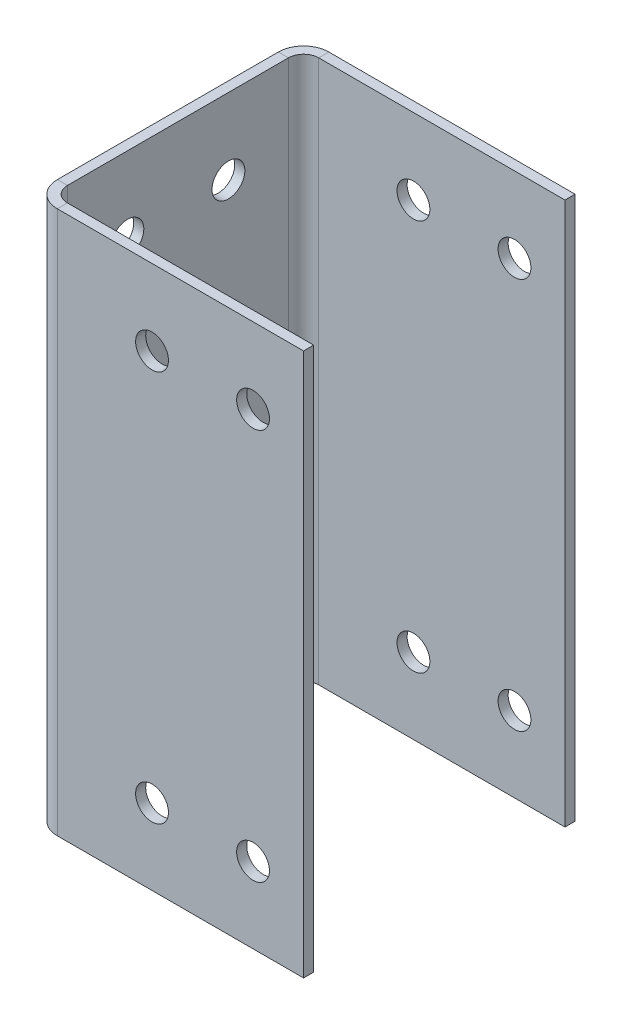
ISO-10303-21;
HEADER;
FILE_DESCRIPTION(('STEP AP214'),'2;1');
FILE_NAME('part.step','',(''),(''),'','','');
FILE_SCHEMA(('AUTOMOTIVE_DESIGN { 1 0 10303 214 1 1 1 1 }'));
ENDSEC;
DATA;
#1=APPLICATION_CONTEXT('core data for automotive mechanical design processes');
#2=APPLICATION_PROTOCOL_DEFINITION('international standard','automotive_design',2000,#1);
#3=PRODUCT_CONTEXT('',#1,'mechanical');
#4=PRODUCT('Part','Part','',(#3));
#5=PRODUCT_RELATED_PRODUCT_CATEGORY('part','',(#4));
#6=PRODUCT_DEFINITION_FORMATION('','',#4);
#7=PRODUCT_DEFINITION_CONTEXT('part definition',#1,'design');
#8=PRODUCT_DEFINITION('design','',#6,#7);
#9=PRODUCT_DEFINITION_SHAPE('','',#8);
#10=(LENGTH_UNIT() NAMED_UNIT(*) SI_UNIT(.MILLI.,.METRE.));
#11=(NAMED_UNIT(*) PLANE_ANGLE_UNIT() SI_UNIT($,.RADIAN.));
#12=(NAMED_UNIT(*) SI_UNIT($,.STERADIAN.) SOLID_ANGLE_UNIT());
#13=UNCERTAINTY_MEASURE_WITH_UNIT(LENGTH_MEASURE(1.E-05),#10,'distance_accuracy_value','');
#14=(GEOMETRIC_REPRESENTATION_CONTEXT(3) GLOBAL_UNCERTAINTY_ASSIGNED_CONTEXT((#13)) GLOBAL_UNIT_ASSIGNED_CONTEXT((#10,
#11,#12)) REPRESENTATION_CONTEXT('',''));
#15=CARTESIAN_POINT('',(0.,0.,0.));
#16=DIRECTION('',(0.,0.,1.));
#17=DIRECTION('',(1.,0.,0.));
#18=AXIS2_PLACEMENT_3D('',#15,#16,#17);
#19=CARTESIAN_POINT('',(-8.,0.,0.));
#20=DIRECTION('',(1.,0.,0.));
#21=DIRECTION('',(0.,0.,-1.));
#22=AXIS2_PLACEMENT_3D('',#19,#20,#21);
#23=PLANE('',#22);
#24=CARTESIAN_POINT('',(-8.,60.,67.5000000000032));
#25=DIRECTION('',(-1.,0.,0.));
#26=DIRECTION('',(0.,0.,1.));
#27=AXIS2_PLACEMENT_3D('',#24,#25,#26);
#28=CIRCLE('',#27,13.);
#29=CARTESIAN_POINT('',(-8.,60.,80.5000000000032));
#30=VERTEX_POINT('',#29);
#31=EDGE_CURVE('E770',#30,#30,#28,.T.);
#32=ORIENTED_EDGE('',*,*,#31,.F.);
#33=EDGE_LOOP('',(#32));
#34=FACE_BOUND('',#33,.T.);
#35=CARTESIAN_POINT('',(-8.,60.,147.500000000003));
#36=DIRECTION('',(-1.,0.,0.));
#37=DIRECTION('',(0.,0.,1.));
#38=AXIS2_PLACEMENT_3D('',#35,#36,#37);
#39=CIRCLE('',#38,13.);
#40=CARTESIAN_POINT('',(-8.,60.,160.500000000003));
#41=VERTEX_POINT('',#40);
#42=EDGE_CURVE('E771',#41,#41,#39,.T.);
#43=ORIENTED_EDGE('',*,*,#42,.F.);
#44=EDGE_LOOP('',(#43));
#45=FACE_BOUND('',#44,.T.);
#46=CARTESIAN_POINT('',(-8.,370.,147.5));
#47=DIRECTION('',(-1.,0.,0.));
#48=DIRECTION('',(0.,0.,1.));
#49=AXIS2_PLACEMENT_3D('',#46,#47,#48);
#50=CIRCLE('',#49,13.);
#51=CARTESIAN_POINT('',(-8.,370.,160.5));
#52=VERTEX_POINT('',#51);
#53=EDGE_CURVE('E774',#52,#52,#50,.T.);
#54=ORIENTED_EDGE('',*,*,#53,.F.);
#55=EDGE_LOOP('',(#54));
#56=FACE_BOUND('',#55,.T.);
#57=CARTESIAN_POINT('',(-8.,370.,67.5));
#58=DIRECTION('',(-1.,0.,0.));
#59=DIRECTION('',(0.,0.,1.));
#60=AXIS2_PLACEMENT_3D('',#57,#58,#59);
#61=CIRCLE('',#60,13.);
#62=CARTESIAN_POINT('',(-8.,370.,80.5));
#63=VERTEX_POINT('',#62);
#64=EDGE_CURVE('E311',#63,#63,#61,.T.);
#65=ORIENTED_EDGE('',*,*,#64,.F.);
#66=EDGE_LOOP('',(#65));
#67=FACE_BOUND('',#66,.T.);
#68=DIRECTION('',(0.,1.,0.));
#69=VECTOR('',#68,1.);
#70=CARTESIAN_POINT('',(-8.00000000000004,430.,20.));
#71=LINE('',#70,#69);
#72=CARTESIAN_POINT('',(-8.00000000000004,430.,20.));
#73=VERTEX_POINT('',#72);
#74=CARTESIAN_POINT('',(-8.,0.,20.));
#75=VERTEX_POINT('',#74);
#76=EDGE_CURVE('E213',#73,#75,#71,.F.);
#77=ORIENTED_EDGE('',*,*,#76,.T.);
#78=DIRECTION('',(0.,0.,-1.));
#79=VECTOR('',#78,1.);
#80=CARTESIAN_POINT('',(-8.,0.,0.));
#81=LINE('',#80,#79);
#82=CARTESIAN_POINT('',(-8.00000000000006,0.,195.));
#83=VERTEX_POINT('',#82);
#84=EDGE_CURVE('E13',#83,#75,#81,.T.);
#85=ORIENTED_EDGE('',*,*,#84,.F.);
#86=DIRECTION('',(0.,-1.,0.));
#87=VECTOR('',#86,1.);
#88=CARTESIAN_POINT('',(-8.00000000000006,0.,195.));
#89=LINE('',#88,#87);
#90=CARTESIAN_POINT('',(-8.,430.,195.));
#91=VERTEX_POINT('',#90);
#92=EDGE_CURVE('E266',#83,#91,#89,.F.);
#93=ORIENTED_EDGE('',*,*,#92,.T.);
#94=DIRECTION('',(0.,0.,1.));
#95=VECTOR('',#94,1.);
#96=CARTESIAN_POINT('',(-8.,430.,0.));
#97=LINE('',#96,#95);
#98=EDGE_CURVE('E88',#73,#91,#97,.T.);
#99=ORIENTED_EDGE('',*,*,#98,.F.);
#100=EDGE_LOOP('',(#77,#85,#93,#99));
#101=FACE_BOUND('',#100,.T.);
#102=ADVANCED_FACE('F79',(#34,#45,#56,#67,#101),#23,.F.);
#103=CARTESIAN_POINT('',(0.,0.,0.));
#104=DIRECTION('',(1.,0.,0.));
#105=DIRECTION('',(0.,0.,-1.));
#106=AXIS2_PLACEMENT_3D('',#103,#104,#105);
#107=PLANE('',#106);
#108=CARTESIAN_POINT('',(0.,60.,67.5000000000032));
#109=DIRECTION('',(1.,0.,0.));
#110=DIRECTION('',(0.,0.,-1.));
#111=AXIS2_PLACEMENT_3D('',#108,#109,#110);
#112=CIRCLE('',#111,13.);
#113=CARTESIAN_POINT('',(0.,60.,54.5000000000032));
#114=VERTEX_POINT('',#113);
#115=EDGE_CURVE('E83',#114,#114,#112,.T.);
#116=ORIENTED_EDGE('',*,*,#115,.F.);
#117=EDGE_LOOP('',(#116));
#118=FACE_BOUND('',#117,.T.);
#119=CARTESIAN_POINT('',(0.,60.,147.500000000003));
#120=DIRECTION('',(1.,0.,0.));
#121=DIRECTION('',(0.,0.,-1.));
#122=AXIS2_PLACEMENT_3D('',#119,#120,#121);
#123=CIRCLE('',#122,13.);
#124=CARTESIAN_POINT('',(0.,60.,134.500000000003));
#125=VERTEX_POINT('',#124);
#126=EDGE_CURVE('E313',#125,#125,#123,.T.);
#127=ORIENTED_EDGE('',*,*,#126,.F.);
#128=EDGE_LOOP('',(#127));
#129=FACE_BOUND('',#128,.T.);
#130=CARTESIAN_POINT('',(0.,370.,147.5));
#131=DIRECTION('',(1.,0.,0.));
#132=DIRECTION('',(0.,0.,-1.));
#133=AXIS2_PLACEMENT_3D('',#130,#131,#132);
#134=CIRCLE('',#133,13.);
#135=CARTESIAN_POINT('',(0.,370.,134.5));
#136=VERTEX_POINT('',#135);
#137=EDGE_CURVE('E310',#136,#136,#134,.T.);
#138=ORIENTED_EDGE('',*,*,#137,.F.);
#139=EDGE_LOOP('',(#138));
#140=FACE_BOUND('',#139,.T.);
#141=CARTESIAN_POINT('',(0.,370.,67.5));
#142=DIRECTION('',(1.,0.,0.));
#143=DIRECTION('',(0.,0.,-1.));
#144=AXIS2_PLACEMENT_3D('',#141,#142,#143);
#145=CIRCLE('',#144,13.);
#146=CARTESIAN_POINT('',(0.,370.,54.5));
#147=VERTEX_POINT('',#146);
#148=EDGE_CURVE('E307',#147,#147,#145,.T.);
#149=ORIENTED_EDGE('',*,*,#148,.F.);
#150=EDGE_LOOP('',(#149));
#151=FACE_BOUND('',#150,.T.);
#152=DIRECTION('',(0.,0.,-1.));
#153=VECTOR('',#152,1.);
#154=CARTESIAN_POINT('',(0.,0.,0.));
#155=LINE('',#154,#153);
#156=CARTESIAN_POINT('',(0.,0.,195.));
#157=VERTEX_POINT('',#156);
#158=CARTESIAN_POINT('',(0.,0.,20.));
#159=VERTEX_POINT('',#158);
#160=EDGE_CURVE('E287',#157,#159,#155,.T.);
#161=ORIENTED_EDGE('',*,*,#160,.T.);
#162=DIRECTION('',(0.,1.,0.));
#163=VECTOR('',#162,1.);
#164=CARTESIAN_POINT('',(0.,430.,20.));
#165=LINE('',#164,#163);
#166=CARTESIAN_POINT('',(0.,430.,20.));
#167=VERTEX_POINT('',#166);
#168=EDGE_CURVE('E225',#167,#159,#165,.F.);
#169=ORIENTED_EDGE('',*,*,#168,.F.);
#170=DIRECTION('',(0.,0.,1.));
#171=VECTOR('',#170,1.);
#172=CARTESIAN_POINT('',(0.,430.,0.));
#173=LINE('',#172,#171);
#174=CARTESIAN_POINT('',(0.,430.,195.));
#175=VERTEX_POINT('',#174);
#176=EDGE_CURVE('E284',#167,#175,#173,.T.);
#177=ORIENTED_EDGE('',*,*,#176,.T.);
#178=DIRECTION('',(0.,-1.,0.));
#179=VECTOR('',#178,1.);
#180=CARTESIAN_POINT('',(0.,0.,195.));
#181=LINE('',#180,#179);
#182=EDGE_CURVE('E96',#157,#175,#181,.F.);
#183=ORIENTED_EDGE('',*,*,#182,.F.);
#184=EDGE_LOOP('',(#161,#169,#177,#183));
#185=FACE_BOUND('',#184,.T.);
#186=ADVANCED_FACE('F370',(#118,#129,#140,#151,#185),#107,.T.);
#187=CARTESIAN_POINT('',(-8.,430.,0.));
#188=DIRECTION('',(0.,1.,0.));
#189=DIRECTION('',(0.,0.,1.));
#190=AXIS2_PLACEMENT_3D('',#187,#188,#189);
#191=PLANE('',#190);
#192=ORIENTED_EDGE('',*,*,#176,.F.);
#193=DIRECTION('',(-1.,0.,0.));
#194=VECTOR('',#193,1.);
#195=CARTESIAN_POINT('',(0.,430.,20.));
#196=LINE('',#195,#194);
#197=EDGE_CURVE('E219',#167,#73,#196,.T.);
#198=ORIENTED_EDGE('',*,*,#197,.T.);
#199=ORIENTED_EDGE('',*,*,#98,.T.);
#200=DIRECTION('',(-1.,0.,0.));
#201=VECTOR('',#200,1.);
#202=CARTESIAN_POINT('',(0.,430.,195.));
#203=LINE('',#202,#201);
#204=EDGE_CURVE('E281',#175,#91,#203,.T.);
#205=ORIENTED_EDGE('',*,*,#204,.F.);
#206=EDGE_LOOP('',(#192,#198,#199,#205));
#207=FACE_BOUND('',#206,.T.);
#208=ADVANCED_FACE('F81',(#207),#191,.T.);
#209=CARTESIAN_POINT('',(-8.,0.,0.));
#210=DIRECTION('',(0.,-1.,0.));
#211=DIRECTION('',(0.,0.,-1.));
#212=AXIS2_PLACEMENT_3D('',#209,#210,#211);
#213=PLANE('',#212);
#214=DIRECTION('',(-1.,0.,0.));
#215=VECTOR('',#214,1.);
#216=CARTESIAN_POINT('',(0.,0.,20.));
#217=LINE('',#216,#215);
#218=EDGE_CURVE('E231',#159,#75,#217,.T.);
#219=ORIENTED_EDGE('',*,*,#218,.F.);
#220=ORIENTED_EDGE('',*,*,#160,.F.);
#221=DIRECTION('',(-1.,0.,0.));
#222=VECTOR('',#221,1.);
#223=CARTESIAN_POINT('',(0.,0.,195.));
#224=LINE('',#223,#222);
#225=EDGE_CURVE('E272',#157,#83,#224,.T.);
#226=ORIENTED_EDGE('',*,*,#225,.T.);
#227=ORIENTED_EDGE('',*,*,#84,.T.);
#228=EDGE_LOOP('',(#219,#220,#226,#227));
#229=FACE_BOUND('',#228,.T.);
#230=ADVANCED_FACE('F383',(#229),#213,.T.);
#231=CARTESIAN_POINT('',(12.,430.,195.));
#232=DIRECTION('',(0.,1.,0.));
#233=DIRECTION('',(0.,0.,1.));
#234=AXIS2_PLACEMENT_3D('',#231,#232,#233);
#235=PLANE('',#234);
#236=DIRECTION('',(0.,0.,-1.));
#237=VECTOR('',#236,1.);
#238=CARTESIAN_POINT('',(12.,430.,215.));
#239=LINE('',#238,#237);
#240=CARTESIAN_POINT('',(11.9999999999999,430.,207.));
#241=VERTEX_POINT('',#240);
#242=CARTESIAN_POINT('',(11.9999999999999,430.,215.));
#243=VERTEX_POINT('',#242);
#244=EDGE_CURVE('E234',#241,#243,#239,.F.);
#245=ORIENTED_EDGE('',*,*,#244,.F.);
#246=CARTESIAN_POINT('',(12.,430.,195.));
#247=DIRECTION('',(0.,-1.,0.));
#248=DIRECTION('',(0.,0.,-1.));
#249=AXIS2_PLACEMENT_3D('',#246,#247,#248);
#250=CIRCLE('',#249,12.);
#251=EDGE_CURVE('E275',#175,#241,#250,.F.);
#252=ORIENTED_EDGE('',*,*,#251,.F.);
#253=ORIENTED_EDGE('',*,*,#204,.T.);
#254=CARTESIAN_POINT('',(12.,430.,195.));
#255=DIRECTION('',(0.,-1.,0.));
#256=DIRECTION('',(0.,0.,-1.));
#257=AXIS2_PLACEMENT_3D('',#254,#255,#256);
#258=CIRCLE('',#257,20.);
#259=EDGE_CURVE('E268',#91,#243,#258,.F.);
#260=ORIENTED_EDGE('',*,*,#259,.T.);
#261=EDGE_LOOP('',(#245,#252,#253,#260));
#262=FACE_BOUND('',#261,.T.);
#263=ADVANCED_FACE('F385',(#262),#235,.T.);
#264=CARTESIAN_POINT('',(12.,0.,195.));
#265=DIRECTION('',(0.,1.,0.));
#266=DIRECTION('',(0.,0.,1.));
#267=AXIS2_PLACEMENT_3D('',#264,#265,#266);
#268=PLANE('',#267);
#269=CARTESIAN_POINT('',(12.,0.,195.));
#270=DIRECTION('',(0.,-1.,0.));
#271=DIRECTION('',(0.,0.,-1.));
#272=AXIS2_PLACEMENT_3D('',#269,#270,#271);
#273=CIRCLE('',#272,12.);
#274=CARTESIAN_POINT('',(11.9999999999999,0.,207.));
#275=VERTEX_POINT('',#274);
#276=EDGE_CURVE('E239',#275,#157,#273,.T.);
#277=ORIENTED_EDGE('',*,*,#276,.F.);
#278=DIRECTION('',(0.,0.,-1.));
#279=VECTOR('',#278,1.);
#280=CARTESIAN_POINT('',(12.,0.,207.));
#281=LINE('',#280,#279);
#282=CARTESIAN_POINT('',(12.,0.,215.));
#283=VERTEX_POINT('',#282);
#284=EDGE_CURVE('E259',#275,#283,#281,.F.);
#285=ORIENTED_EDGE('',*,*,#284,.T.);
#286=CARTESIAN_POINT('',(12.,0.,195.));
#287=DIRECTION('',(0.,-1.,0.));
#288=DIRECTION('',(0.,0.,-1.));
#289=AXIS2_PLACEMENT_3D('',#286,#287,#288);
#290=CIRCLE('',#289,20.);
#291=EDGE_CURVE('E269',#283,#83,#290,.T.);
#292=ORIENTED_EDGE('',*,*,#291,.T.);
#293=ORIENTED_EDGE('',*,*,#225,.F.);
#294=EDGE_LOOP('',(#277,#285,#292,#293));
#295=FACE_BOUND('',#294,.T.);
#296=ADVANCED_FACE('F381',(#295),#268,.F.);
#297=CARTESIAN_POINT('',(12.,0.,195.));
#298=DIRECTION('',(0.,-1.,0.));
#299=DIRECTION('',(0.,0.,1.));
#300=AXIS2_PLACEMENT_3D('',#297,#298,#299);
#301=CYLINDRICAL_SURFACE('',#300,20.);
#302=ORIENTED_EDGE('',*,*,#92,.F.);
#303=ORIENTED_EDGE('',*,*,#291,.F.);
#304=DIRECTION('',(0.,-1.,0.));
#305=VECTOR('',#304,1.);
#306=CARTESIAN_POINT('',(12.,430.,215.));
#307=LINE('',#306,#305);
#308=EDGE_CURVE('E257',#283,#243,#307,.F.);
#309=ORIENTED_EDGE('',*,*,#308,.T.);
#310=ORIENTED_EDGE('',*,*,#259,.F.);
#311=EDGE_LOOP('',(#302,#303,#309,#310));
#312=FACE_BOUND('',#311,.T.);
#313=ADVANCED_FACE('F441',(#312),#301,.T.);
#314=CARTESIAN_POINT('',(12.,0.,195.));
#315=DIRECTION('',(0.,-1.,0.));
#316=DIRECTION('',(0.,0.,1.));
#317=AXIS2_PLACEMENT_3D('',#314,#315,#316);
#318=CYLINDRICAL_SURFACE('',#317,12.);
#319=ORIENTED_EDGE('',*,*,#182,.T.);
#320=ORIENTED_EDGE('',*,*,#251,.T.);
#321=DIRECTION('',(0.,-1.,0.));
#322=VECTOR('',#321,1.);
#323=CARTESIAN_POINT('',(12.,430.,207.));
#324=LINE('',#323,#322);
#325=EDGE_CURVE('E262',#241,#275,#324,.T.);
#326=ORIENTED_EDGE('',*,*,#325,.T.);
#327=ORIENTED_EDGE('',*,*,#276,.T.);
#328=EDGE_LOOP('',(#319,#320,#326,#327));
#329=FACE_BOUND('',#328,.T.);
#330=ADVANCED_FACE('F405',(#329),#318,.F.);
#331=CARTESIAN_POINT('',(0.,430.,215.));
#332=DIRECTION('',(0.,-1.,0.));
#333=DIRECTION('',(0.,0.,-1.));
#334=AXIS2_PLACEMENT_3D('',#331,#332,#333);
#335=PLANE('',#334);
#336=ORIENTED_EDGE('',*,*,#244,.T.);
#337=DIRECTION('',(-1.,0.,0.));
#338=VECTOR('',#337,1.);
#339=CARTESIAN_POINT('',(-7.77466477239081E-13,430.,215.));
#340=LINE('',#339,#338);
#341=CARTESIAN_POINT('',(207.,430.,215.000000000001));
#342=VERTEX_POINT('',#341);
#343=EDGE_CURVE('E247',#342,#243,#340,.T.);
#344=ORIENTED_EDGE('',*,*,#343,.F.);
#345=DIRECTION('',(0.,0.,-1.));
#346=VECTOR('',#345,1.);
#347=CARTESIAN_POINT('',(207.,430.,215.000000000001));
#348=LINE('',#347,#346);
#349=CARTESIAN_POINT('',(207.,430.,207.000000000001));
#350=VERTEX_POINT('',#349);
#351=EDGE_CURVE('E240',#342,#350,#348,.T.);
#352=ORIENTED_EDGE('',*,*,#351,.T.);
#353=DIRECTION('',(1.,0.,0.));
#354=VECTOR('',#353,1.);
#355=CARTESIAN_POINT('',(0.,430.,207.));
#356=LINE('',#355,#354);
#357=EDGE_CURVE('E254',#350,#241,#356,.F.);
#358=ORIENTED_EDGE('',*,*,#357,.T.);
#359=EDGE_LOOP('',(#336,#344,#352,#358));
#360=FACE_BOUND('',#359,.T.);
#361=ADVANCED_FACE('F410',(#360),#335,.F.);
#362=CARTESIAN_POINT('',(207.,0.,215.000000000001));
#363=DIRECTION('',(0.,1.,0.));
#364=DIRECTION('',(0.,0.,1.));
#365=AXIS2_PLACEMENT_3D('',#362,#363,#364);
#366=PLANE('',#365);
#367=ORIENTED_EDGE('',*,*,#284,.F.);
#368=DIRECTION('',(-1.,0.,0.));
#369=VECTOR('',#368,1.);
#370=CARTESIAN_POINT('',(207.,0.,207.000000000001));
#371=LINE('',#370,#369);
#372=CARTESIAN_POINT('',(207.,0.,207.000000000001));
#373=VERTEX_POINT('',#372);
#374=EDGE_CURVE('E252',#275,#373,#371,.F.);
#375=ORIENTED_EDGE('',*,*,#374,.T.);
#376=DIRECTION('',(0.,0.,-1.));
#377=VECTOR('',#376,1.);
#378=CARTESIAN_POINT('',(207.,0.,215.000000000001));
#379=LINE('',#378,#377);
#380=CARTESIAN_POINT('',(207.,0.,215.000000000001));
#381=VERTEX_POINT('',#380);
#382=EDGE_CURVE('E236',#381,#373,#379,.T.);
#383=ORIENTED_EDGE('',*,*,#382,.F.);
#384=DIRECTION('',(1.,0.,0.));
#385=VECTOR('',#384,1.);
#386=CARTESIAN_POINT('',(-7.77466477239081E-13,0.,215.));
#387=LINE('',#386,#385);
#388=EDGE_CURVE('E245',#283,#381,#387,.T.);
#389=ORIENTED_EDGE('',*,*,#388,.F.);
#390=EDGE_LOOP('',(#367,#375,#383,#389));
#391=FACE_BOUND('',#390,.T.);
#392=ADVANCED_FACE('F428',(#391),#366,.F.);
#393=CARTESIAN_POINT('',(-7.77466477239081E-13,0.,215.));
#394=DIRECTION('',(0.,0.,-1.));
#395=DIRECTION('',(-1.,0.,0.));
#396=AXIS2_PLACEMENT_3D('',#393,#394,#395);
#397=PLANE('',#396);
#398=CARTESIAN_POINT('',(167.000000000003,60.0000000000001,215.));
#399=DIRECTION('',(0.,0.,1.));
#400=DIRECTION('',(1.,0.,0.));
#401=AXIS2_PLACEMENT_3D('',#398,#399,#400);
#402=CIRCLE('',#401,13.);
#403=CARTESIAN_POINT('',(180.000000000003,60.0000000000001,215.));
#404=VERTEX_POINT('',#403);
#405=EDGE_CURVE('E318',#404,#404,#402,.T.);
#406=ORIENTED_EDGE('',*,*,#405,.F.);
#407=EDGE_LOOP('',(#406));
#408=FACE_BOUND('',#407,.T.);
#409=CARTESIAN_POINT('',(87.0000000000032,59.9999999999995,215.));
#410=DIRECTION('',(0.,0.,1.));
#411=DIRECTION('',(1.,0.,0.));
#412=AXIS2_PLACEMENT_3D('',#409,#410,#411);
#413=CIRCLE('',#412,13.);
#414=CARTESIAN_POINT('',(100.000000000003,59.9999999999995,215.));
#415=VERTEX_POINT('',#414);
#416=EDGE_CURVE('E327',#415,#415,#413,.T.);
#417=ORIENTED_EDGE('',*,*,#416,.F.);
#418=EDGE_LOOP('',(#417));
#419=FACE_BOUND('',#418,.T.);
#420=CARTESIAN_POINT('',(87.,369.999999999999,215.));
#421=DIRECTION('',(0.,0.,1.));
#422=DIRECTION('',(1.,0.,0.));
#423=AXIS2_PLACEMENT_3D('',#420,#421,#422);
#424=CIRCLE('',#423,13.);
#425=CARTESIAN_POINT('',(100.,369.999999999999,215.));
#426=VERTEX_POINT('',#425);
#427=EDGE_CURVE('E782',#426,#426,#424,.T.);
#428=ORIENTED_EDGE('',*,*,#427,.F.);
#429=EDGE_LOOP('',(#428));
#430=FACE_BOUND('',#429,.T.);
#431=CARTESIAN_POINT('',(167.,370.,215.));
#432=DIRECTION('',(0.,0.,1.));
#433=DIRECTION('',(1.,0.,0.));
#434=AXIS2_PLACEMENT_3D('',#431,#432,#433);
#435=CIRCLE('',#434,13.);
#436=CARTESIAN_POINT('',(180.,370.,215.));
#437=VERTEX_POINT('',#436);
#438=EDGE_CURVE('E333',#437,#437,#435,.T.);
#439=ORIENTED_EDGE('',*,*,#438,.F.);
#440=EDGE_LOOP('',(#439));
#441=FACE_BOUND('',#440,.T.);
#442=ORIENTED_EDGE('',*,*,#308,.F.);
#443=ORIENTED_EDGE('',*,*,#388,.T.);
#444=DIRECTION('',(0.,1.,0.));
#445=VECTOR('',#444,1.);
#446=CARTESIAN_POINT('',(207.,0.,215.000000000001));
#447=LINE('',#446,#445);
#448=EDGE_CURVE('E243',#381,#342,#447,.T.);
#449=ORIENTED_EDGE('',*,*,#448,.T.);
#450=ORIENTED_EDGE('',*,*,#343,.T.);
#451=EDGE_LOOP('',(#442,#443,#449,#450));
#452=FACE_BOUND('',#451,.T.);
#453=ADVANCED_FACE('F414',(#408,#419,#430,#441,#452),#397,.F.);
#454=CARTESIAN_POINT('',(-7.49534626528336E-13,0.,207.));
#455=DIRECTION('',(0.,0.,-1.));
#456=DIRECTION('',(-1.,0.,0.));
#457=AXIS2_PLACEMENT_3D('',#454,#455,#456);
#458=PLANE('',#457);
#459=CARTESIAN_POINT('',(167.000000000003,60.0000000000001,207.000000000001));
#460=DIRECTION('',(0.,0.,-1.));
#461=DIRECTION('',(-1.,0.,0.));
#462=AXIS2_PLACEMENT_3D('',#459,#460,#461);
#463=CIRCLE('',#462,13.);
#464=CARTESIAN_POINT('',(154.000000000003,60.0000000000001,207.000000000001));
#465=VERTEX_POINT('',#464);
#466=EDGE_CURVE('E212',#465,#465,#463,.T.);
#467=ORIENTED_EDGE('',*,*,#466,.F.);
#468=EDGE_LOOP('',(#467));
#469=FACE_BOUND('',#468,.T.);
#470=CARTESIAN_POINT('',(87.0000000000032,59.9999999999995,207.));
#471=DIRECTION('',(0.,0.,-1.));
#472=DIRECTION('',(-1.,0.,0.));
#473=AXIS2_PLACEMENT_3D('',#470,#471,#472);
#474=CIRCLE('',#473,13.);
#475=CARTESIAN_POINT('',(74.0000000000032,59.9999999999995,207.));
#476=VERTEX_POINT('',#475);
#477=EDGE_CURVE('E303',#476,#476,#474,.T.);
#478=ORIENTED_EDGE('',*,*,#477,.F.);
#479=EDGE_LOOP('',(#478));
#480=FACE_BOUND('',#479,.T.);
#481=CARTESIAN_POINT('',(87.,369.999999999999,207.));
#482=DIRECTION('',(0.,0.,-1.));
#483=DIRECTION('',(-1.,0.,0.));
#484=AXIS2_PLACEMENT_3D('',#481,#482,#483);
#485=CIRCLE('',#484,13.);
#486=CARTESIAN_POINT('',(74.,369.999999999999,207.));
#487=VERTEX_POINT('',#486);
#488=EDGE_CURVE('E299',#487,#487,#485,.T.);
#489=ORIENTED_EDGE('',*,*,#488,.F.);
#490=EDGE_LOOP('',(#489));
#491=FACE_BOUND('',#490,.T.);
#492=CARTESIAN_POINT('',(167.,370.,207.000000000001));
#493=DIRECTION('',(0.,0.,-1.));
#494=DIRECTION('',(-1.,0.,0.));
#495=AXIS2_PLACEMENT_3D('',#492,#493,#494);
#496=CIRCLE('',#495,13.);
#497=CARTESIAN_POINT('',(154.,370.,207.000000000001));
#498=VERTEX_POINT('',#497);
#499=EDGE_CURVE('E294',#498,#498,#496,.T.);
#500=ORIENTED_EDGE('',*,*,#499,.F.);
#501=EDGE_LOOP('',(#500));
#502=FACE_BOUND('',#501,.T.);
#503=ORIENTED_EDGE('',*,*,#374,.F.);
#504=ORIENTED_EDGE('',*,*,#325,.F.);
#505=ORIENTED_EDGE('',*,*,#357,.F.);
#506=DIRECTION('',(0.,-1.,0.));
#507=VECTOR('',#506,1.);
#508=CARTESIAN_POINT('',(207.,430.,207.000000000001));
#509=LINE('',#508,#507);
#510=EDGE_CURVE('E250',#373,#350,#509,.F.);
#511=ORIENTED_EDGE('',*,*,#510,.F.);
#512=EDGE_LOOP('',(#503,#504,#505,#511));
#513=FACE_BOUND('',#512,.T.);
#514=ADVANCED_FACE('F424',(#469,#480,#491,#502,#513),#458,.T.);
#515=CARTESIAN_POINT('',(207.,430.,215.000000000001));
#516=DIRECTION('',(-1.,0.,0.));
#517=DIRECTION('',(0.,0.,1.));
#518=AXIS2_PLACEMENT_3D('',#515,#516,#517);
#519=PLANE('',#518);
#520=ORIENTED_EDGE('',*,*,#510,.T.);
#521=ORIENTED_EDGE('',*,*,#351,.F.);
#522=ORIENTED_EDGE('',*,*,#448,.F.);
#523=ORIENTED_EDGE('',*,*,#382,.T.);
#524=EDGE_LOOP('',(#520,#521,#522,#523));
#525=FACE_BOUND('',#524,.T.);
#526=ADVANCED_FACE('F420',(#525),#519,.F.);
#527=CARTESIAN_POINT('',(12.,0.,20.));
#528=DIRECTION('',(0.,-1.,0.));
#529=DIRECTION('',(0.,0.,-1.));
#530=AXIS2_PLACEMENT_3D('',#527,#528,#529);
#531=PLANE('',#530);
#532=DIRECTION('',(0.,0.,1.));
#533=VECTOR('',#532,1.);
#534=CARTESIAN_POINT('',(12.,0.,0.));
#535=LINE('',#534,#533);
#536=CARTESIAN_POINT('',(11.9999999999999,0.,7.99999999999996));
#537=VERTEX_POINT('',#536);
#538=CARTESIAN_POINT('',(11.9999999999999,0.,0.));
#539=VERTEX_POINT('',#538);
#540=EDGE_CURVE('E195',#537,#539,#535,.F.);
#541=ORIENTED_EDGE('',*,*,#540,.F.);
#542=CARTESIAN_POINT('',(12.,0.,20.));
#543=DIRECTION('',(0.,1.,0.));
#544=DIRECTION('',(0.,0.,1.));
#545=AXIS2_PLACEMENT_3D('',#542,#543,#544);
#546=CIRCLE('',#545,12.);
#547=EDGE_CURVE('E222',#159,#537,#546,.F.);
#548=ORIENTED_EDGE('',*,*,#547,.F.);
#549=ORIENTED_EDGE('',*,*,#218,.T.);
#550=CARTESIAN_POINT('',(12.,0.,20.));
#551=DIRECTION('',(0.,1.,0.));
#552=DIRECTION('',(0.,0.,1.));
#553=AXIS2_PLACEMENT_3D('',#550,#551,#552);
#554=CIRCLE('',#553,20.);
#555=EDGE_CURVE('E215',#75,#539,#554,.F.);
#556=ORIENTED_EDGE('',*,*,#555,.T.);
#557=EDGE_LOOP('',(#541,#548,#549,#556));
#558=FACE_BOUND('',#557,.T.);
#559=ADVANCED_FACE('F396',(#558),#531,.T.);
#560=CARTESIAN_POINT('',(12.,430.,20.));
#561=DIRECTION('',(0.,-1.,0.));
#562=DIRECTION('',(0.,0.,-1.));
#563=AXIS2_PLACEMENT_3D('',#560,#561,#562);
#564=PLANE('',#563);
#565=CARTESIAN_POINT('',(12.,430.,20.));
#566=DIRECTION('',(0.,1.,0.));
#567=DIRECTION('',(0.,0.,1.));
#568=AXIS2_PLACEMENT_3D('',#565,#566,#567);
#569=CIRCLE('',#568,12.);
#570=CARTESIAN_POINT('',(11.9999999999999,430.,7.99999999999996));
#571=VERTEX_POINT('',#570);
#572=EDGE_CURVE('E228',#571,#167,#569,.T.);
#573=ORIENTED_EDGE('',*,*,#572,.F.);
#574=DIRECTION('',(0.,0.,1.));
#575=VECTOR('',#574,1.);
#576=CARTESIAN_POINT('',(12.,430.,7.99999999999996));
#577=LINE('',#576,#575);
#578=CARTESIAN_POINT('',(12.,430.,0.));
#579=VERTEX_POINT('',#578);
#580=EDGE_CURVE('E206',#571,#579,#577,.F.);
#581=ORIENTED_EDGE('',*,*,#580,.T.);
#582=CARTESIAN_POINT('',(12.,430.,20.));
#583=DIRECTION('',(0.,1.,0.));
#584=DIRECTION('',(0.,0.,1.));
#585=AXIS2_PLACEMENT_3D('',#582,#583,#584);
#586=CIRCLE('',#585,20.);
#587=EDGE_CURVE('E216',#579,#73,#586,.T.);
#588=ORIENTED_EDGE('',*,*,#587,.T.);
#589=ORIENTED_EDGE('',*,*,#197,.F.);
#590=EDGE_LOOP('',(#573,#581,#588,#589));
#591=FACE_BOUND('',#590,.T.);
#592=ADVANCED_FACE('F357',(#591),#564,.F.);
#593=CARTESIAN_POINT('',(12.,430.,20.));
#594=DIRECTION('',(0.,1.,0.));
#595=DIRECTION('',(0.,0.,-1.));
#596=AXIS2_PLACEMENT_3D('',#593,#594,#595);
#597=CYLINDRICAL_SURFACE('',#596,20.);
#598=ORIENTED_EDGE('',*,*,#76,.F.);
#599=ORIENTED_EDGE('',*,*,#587,.F.);
#600=DIRECTION('',(0.,1.,0.));
#601=VECTOR('',#600,1.);
#602=CARTESIAN_POINT('',(12.,0.,0.));
#603=LINE('',#602,#601);
#604=EDGE_CURVE('E204',#579,#539,#603,.F.);
#605=ORIENTED_EDGE('',*,*,#604,.T.);
#606=ORIENTED_EDGE('',*,*,#555,.F.);
#607=EDGE_LOOP('',(#598,#599,#605,#606));
#608=FACE_BOUND('',#607,.T.);
#609=ADVANCED_FACE('F399',(#608),#597,.T.);
#610=CARTESIAN_POINT('',(12.,430.,20.));
#611=DIRECTION('',(0.,1.,0.));
#612=DIRECTION('',(0.,0.,-1.));
#613=AXIS2_PLACEMENT_3D('',#610,#611,#612);
#614=CYLINDRICAL_SURFACE('',#613,12.);
#615=ORIENTED_EDGE('',*,*,#168,.T.);
#616=ORIENTED_EDGE('',*,*,#547,.T.);
#617=DIRECTION('',(0.,1.,0.));
#618=VECTOR('',#617,1.);
#619=CARTESIAN_POINT('',(12.,0.,7.99999999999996));
#620=LINE('',#619,#618);
#621=EDGE_CURVE('E209',#537,#571,#620,.T.);
#622=ORIENTED_EDGE('',*,*,#621,.T.);
#623=ORIENTED_EDGE('',*,*,#572,.T.);
#624=EDGE_LOOP('',(#615,#616,#622,#623));
#625=FACE_BOUND('',#624,.T.);
#626=ADVANCED_FACE('F352',(#625),#614,.F.);
#627=CARTESIAN_POINT('',(0.,0.,0.));
#628=DIRECTION('',(0.,1.,0.));
#629=DIRECTION('',(0.,0.,1.));
#630=AXIS2_PLACEMENT_3D('',#627,#628,#629);
#631=PLANE('',#630);
#632=ORIENTED_EDGE('',*,*,#540,.T.);
#633=DIRECTION('',(-1.,0.,0.));
#634=VECTOR('',#633,1.);
#635=CARTESIAN_POINT('',(0.,0.,0.));
#636=LINE('',#635,#634);
#637=CARTESIAN_POINT('',(207.,0.,-7.22736637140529E-13));
#638=VERTEX_POINT('',#637);
#639=EDGE_CURVE('E176',#638,#539,#636,.T.);
#640=ORIENTED_EDGE('',*,*,#639,.F.);
#641=DIRECTION('',(0.,0.,1.));
#642=VECTOR('',#641,1.);
#643=CARTESIAN_POINT('',(207.,0.,-7.22736637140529E-13));
#644=LINE('',#643,#642);
#645=CARTESIAN_POINT('',(207.,0.,7.99999999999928));
#646=VERTEX_POINT('',#645);
#647=EDGE_CURVE('E182',#638,#646,#644,.T.);
#648=ORIENTED_EDGE('',*,*,#647,.T.);
#649=DIRECTION('',(1.,0.,0.));
#650=VECTOR('',#649,1.);
#651=CARTESIAN_POINT('',(0.,0.,8.));
#652=LINE('',#651,#650);
#653=EDGE_CURVE('E202',#646,#537,#652,.F.);
#654=ORIENTED_EDGE('',*,*,#653,.T.);
#655=EDGE_LOOP('',(#632,#640,#648,#654));
#656=FACE_BOUND('',#655,.T.);
#657=ADVANCED_FACE('F194',(#656),#631,.F.);
#658=CARTESIAN_POINT('',(207.,430.,-7.23379689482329E-13));
#659=DIRECTION('',(0.,-1.,0.));
#660=DIRECTION('',(0.,0.,-1.));
#661=AXIS2_PLACEMENT_3D('',#658,#659,#660);
#662=PLANE('',#661);
#663=ORIENTED_EDGE('',*,*,#580,.F.);
#664=DIRECTION('',(-1.,0.,0.));
#665=VECTOR('',#664,1.);
#666=CARTESIAN_POINT('',(207.,430.,7.99999999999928));
#667=LINE('',#666,#665);
#668=CARTESIAN_POINT('',(207.,430.,7.99999999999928));
#669=VERTEX_POINT('',#668);
#670=EDGE_CURVE('E198',#571,#669,#667,.F.);
#671=ORIENTED_EDGE('',*,*,#670,.T.);
#672=DIRECTION('',(0.,0.,1.));
#673=VECTOR('',#672,1.);
#674=CARTESIAN_POINT('',(207.,430.,-7.23379689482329E-13));
#675=LINE('',#674,#673);
#676=CARTESIAN_POINT('',(207.,430.,-7.22736637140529E-13));
#677=VERTEX_POINT('',#676);
#678=EDGE_CURVE('E191',#677,#669,#675,.T.);
#679=ORIENTED_EDGE('',*,*,#678,.F.);
#680=DIRECTION('',(1.,0.,0.));
#681=VECTOR('',#680,1.);
#682=CARTESIAN_POINT('',(0.,430.,0.));
#683=LINE('',#682,#681);
#684=EDGE_CURVE('E178',#579,#677,#683,.T.);
#685=ORIENTED_EDGE('',*,*,#684,.F.);
#686=EDGE_LOOP('',(#663,#671,#679,#685));
#687=FACE_BOUND('',#686,.T.);
#688=ADVANCED_FACE('F358',(#687),#662,.F.);
#689=CARTESIAN_POINT('',(0.,0.,0.));
#690=DIRECTION('',(0.,0.,1.));
#691=DIRECTION('',(1.,0.,0.));
#692=AXIS2_PLACEMENT_3D('',#689,#690,#691);
#693=PLANE('',#692);
#694=CARTESIAN_POINT('',(167.000000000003,60.0000000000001,-7.21644966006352E-13));
#695=DIRECTION('',(0.,0.,1.));
#696=DIRECTION('',(1.,0.,0.));
#697=AXIS2_PLACEMENT_3D('',#694,#695,#696);
#698=CIRCLE('',#697,13.);
#699=CARTESIAN_POINT('',(180.000000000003,60.0000000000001,-7.21644966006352E-13));
#700=VERTEX_POINT('',#699);
#701=EDGE_CURVE('E322',#700,#700,#698,.T.);
#702=ORIENTED_EDGE('',*,*,#701,.T.);
#703=EDGE_LOOP('',(#702));
#704=FACE_BOUND('',#703,.T.);
#705=CARTESIAN_POINT('',(87.0000000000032,59.9999999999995,-7.21644966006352E-13));
#706=DIRECTION('',(0.,0.,1.));
#707=DIRECTION('',(1.,0.,0.));
#708=AXIS2_PLACEMENT_3D('',#705,#706,#707);
#709=CIRCLE('',#708,13.);
#710=CARTESIAN_POINT('',(100.000000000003,59.9999999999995,-7.21644966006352E-13));
#711=VERTEX_POINT('',#710);
#712=EDGE_CURVE('E785',#711,#711,#709,.T.);
#713=ORIENTED_EDGE('',*,*,#712,.T.);
#714=EDGE_LOOP('',(#713));
#715=FACE_BOUND('',#714,.T.);
#716=CARTESIAN_POINT('',(87.,369.999999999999,-7.21644966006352E-13));
#717=DIRECTION('',(0.,0.,1.));
#718=DIRECTION('',(1.,0.,0.));
#719=AXIS2_PLACEMENT_3D('',#716,#717,#718);
#720=CIRCLE('',#719,13.);
#721=CARTESIAN_POINT('',(100.,369.999999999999,-7.21644966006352E-13));
#722=VERTEX_POINT('',#721);
#723=EDGE_CURVE('E336',#722,#722,#720,.T.);
#724=ORIENTED_EDGE('',*,*,#723,.T.);
#725=EDGE_LOOP('',(#724));
#726=FACE_BOUND('',#725,.T.);
#727=CARTESIAN_POINT('',(167.,370.,-7.21644966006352E-13));
#728=DIRECTION('',(0.,0.,1.));
#729=DIRECTION('',(1.,0.,0.));
#730=AXIS2_PLACEMENT_3D('',#727,#728,#729);
#731=CIRCLE('',#730,13.);
#732=CARTESIAN_POINT('',(180.,370.,-7.21644966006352E-13));
#733=VERTEX_POINT('',#732);
#734=EDGE_CURVE('E295',#733,#733,#731,.T.);
#735=ORIENTED_EDGE('',*,*,#734,.T.);
#736=EDGE_LOOP('',(#735));
#737=FACE_BOUND('',#736,.T.);
#738=ORIENTED_EDGE('',*,*,#604,.F.);
#739=ORIENTED_EDGE('',*,*,#684,.T.);
#740=DIRECTION('',(0.,-1.,0.));
#741=VECTOR('',#740,1.);
#742=CARTESIAN_POINT('',(207.,0.,-7.22736637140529E-13));
#743=LINE('',#742,#741);
#744=EDGE_CURVE('E171',#677,#638,#743,.T.);
#745=ORIENTED_EDGE('',*,*,#744,.T.);
#746=ORIENTED_EDGE('',*,*,#639,.T.);
#747=EDGE_LOOP('',(#738,#739,#745,#746));
#748=FACE_BOUND('',#747,.T.);
#749=ADVANCED_FACE('F174',(#704,#715,#726,#737,#748),#693,.F.);
#750=CARTESIAN_POINT('',(0.,0.,8.));
#751=DIRECTION('',(0.,0.,1.));
#752=DIRECTION('',(1.,0.,0.));
#753=AXIS2_PLACEMENT_3D('',#750,#751,#752);
#754=PLANE('',#753);
#755=CARTESIAN_POINT('',(167.000000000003,60.0000000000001,7.99999999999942));
#756=DIRECTION('',(0.,0.,1.));
#757=DIRECTION('',(1.,0.,0.));
#758=AXIS2_PLACEMENT_3D('',#755,#756,#757);
#759=CIRCLE('',#758,13.);
#760=CARTESIAN_POINT('',(180.000000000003,60.0000000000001,7.99999999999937));
#761=VERTEX_POINT('',#760);
#762=EDGE_CURVE('E304',#761,#761,#759,.T.);
#763=ORIENTED_EDGE('',*,*,#762,.F.);
#764=EDGE_LOOP('',(#763));
#765=FACE_BOUND('',#764,.T.);
#766=CARTESIAN_POINT('',(87.0000000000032,59.9999999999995,7.9999999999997));
#767=DIRECTION('',(0.,0.,1.));
#768=DIRECTION('',(1.,0.,0.));
#769=AXIS2_PLACEMENT_3D('',#766,#767,#768);
#770=CIRCLE('',#769,13.);
#771=CARTESIAN_POINT('',(100.000000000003,59.9999999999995,7.99999999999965));
#772=VERTEX_POINT('',#771);
#773=EDGE_CURVE('E300',#772,#772,#770,.T.);
#774=ORIENTED_EDGE('',*,*,#773,.F.);
#775=EDGE_LOOP('',(#774));
#776=FACE_BOUND('',#775,.T.);
#777=CARTESIAN_POINT('',(87.,369.999999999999,7.9999999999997));
#778=DIRECTION('',(0.,0.,1.));
#779=DIRECTION('',(1.,0.,0.));
#780=AXIS2_PLACEMENT_3D('',#777,#778,#779);
#781=CIRCLE('',#780,13.);
#782=CARTESIAN_POINT('',(100.,369.999999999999,7.99999999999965));
#783=VERTEX_POINT('',#782);
#784=EDGE_CURVE('E296',#783,#783,#781,.T.);
#785=ORIENTED_EDGE('',*,*,#784,.F.);
#786=EDGE_LOOP('',(#785));
#787=FACE_BOUND('',#786,.T.);
#788=CARTESIAN_POINT('',(167.,370.,7.99999999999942));
#789=DIRECTION('',(0.,0.,1.));
#790=DIRECTION('',(1.,0.,0.));
#791=AXIS2_PLACEMENT_3D('',#788,#789,#790);
#792=CIRCLE('',#791,13.);
#793=CARTESIAN_POINT('',(180.,370.,7.99999999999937));
#794=VERTEX_POINT('',#793);
#795=EDGE_CURVE('E291',#794,#794,#792,.T.);
#796=ORIENTED_EDGE('',*,*,#795,.F.);
#797=EDGE_LOOP('',(#796));
#798=FACE_BOUND('',#797,.T.);
#799=ORIENTED_EDGE('',*,*,#670,.F.);
#800=ORIENTED_EDGE('',*,*,#621,.F.);
#801=ORIENTED_EDGE('',*,*,#653,.F.);
#802=DIRECTION('',(0.,1.,0.));
#803=VECTOR('',#802,1.);
#804=CARTESIAN_POINT('',(207.,0.,7.99999999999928));
#805=LINE('',#804,#803);
#806=EDGE_CURVE('E187',#669,#646,#805,.F.);
#807=ORIENTED_EDGE('',*,*,#806,.F.);
#808=EDGE_LOOP('',(#799,#800,#801,#807));
#809=FACE_BOUND('',#808,.T.);
#810=ADVANCED_FACE('F348',(#765,#776,#787,#798,#809),#754,.T.);
#811=CARTESIAN_POINT('',(207.,0.,-7.23379689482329E-13));
#812=DIRECTION('',(-1.,0.,0.));
#813=DIRECTION('',(0.,0.,1.));
#814=AXIS2_PLACEMENT_3D('',#811,#812,#813);
#815=PLANE('',#814);
#816=ORIENTED_EDGE('',*,*,#806,.T.);
#817=ORIENTED_EDGE('',*,*,#647,.F.);
#818=ORIENTED_EDGE('',*,*,#744,.F.);
#819=ORIENTED_EDGE('',*,*,#678,.T.);
#820=EDGE_LOOP('',(#816,#817,#818,#819));
#821=FACE_BOUND('',#820,.T.);
#822=ADVANCED_FACE('F185',(#821),#815,.F.);
#823=CARTESIAN_POINT('',(167.,370.,-7.21644966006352E-13));
#824=DIRECTION('',(0.,0.,1.));
#825=DIRECTION('',(1.,0.,0.));
#826=AXIS2_PLACEMENT_3D('',#823,#824,#825);
#827=CYLINDRICAL_SURFACE('',#826,13.);
#828=ORIENTED_EDGE('',*,*,#795,.T.);
#829=EDGE_LOOP('',(#828));
#830=FACE_BOUND('',#829,.T.);
#831=ORIENTED_EDGE('',*,*,#734,.F.);
#832=EDGE_LOOP('',(#831));
#833=FACE_BOUND('',#832,.T.);
#834=ADVANCED_FACE('F530',(#830,#833),#827,.F.);
#835=CARTESIAN_POINT('',(87.,369.999999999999,-7.21644966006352E-13));
#836=DIRECTION('',(0.,0.,1.));
#837=DIRECTION('',(1.,0.,0.));
#838=AXIS2_PLACEMENT_3D('',#835,#836,#837);
#839=CYLINDRICAL_SURFACE('',#838,13.);
#840=ORIENTED_EDGE('',*,*,#784,.T.);
#841=EDGE_LOOP('',(#840));
#842=FACE_BOUND('',#841,.T.);
#843=ORIENTED_EDGE('',*,*,#723,.F.);
#844=EDGE_LOOP('',(#843));
#845=FACE_BOUND('',#844,.T.);
#846=ADVANCED_FACE('F568',(#842,#845),#839,.F.);
#847=CARTESIAN_POINT('',(87.0000000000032,59.9999999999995,-7.21644966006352E-13));
#848=DIRECTION('',(0.,0.,1.));
#849=DIRECTION('',(1.,0.,0.));
#850=AXIS2_PLACEMENT_3D('',#847,#848,#849);
#851=CYLINDRICAL_SURFACE('',#850,13.);
#852=ORIENTED_EDGE('',*,*,#773,.T.);
#853=EDGE_LOOP('',(#852));
#854=FACE_BOUND('',#853,.T.);
#855=ORIENTED_EDGE('',*,*,#712,.F.);
#856=EDGE_LOOP('',(#855));
#857=FACE_BOUND('',#856,.T.);
#858=ADVANCED_FACE('F580',(#854,#857),#851,.F.);
#859=CARTESIAN_POINT('',(167.000000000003,60.0000000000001,-7.21644966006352E-13));
#860=DIRECTION('',(0.,0.,1.));
#861=DIRECTION('',(1.,0.,0.));
#862=AXIS2_PLACEMENT_3D('',#859,#860,#861);
#863=CYLINDRICAL_SURFACE('',#862,13.);
#864=ORIENTED_EDGE('',*,*,#762,.T.);
#865=EDGE_LOOP('',(#864));
#866=FACE_BOUND('',#865,.T.);
#867=ORIENTED_EDGE('',*,*,#701,.F.);
#868=EDGE_LOOP('',(#867));
#869=FACE_BOUND('',#868,.T.);
#870=ADVANCED_FACE('F592',(#866,#869),#863,.F.);
#871=ORIENTED_EDGE('',*,*,#499,.T.);
#872=EDGE_LOOP('',(#871));
#873=FACE_BOUND('',#872,.T.);
#874=ORIENTED_EDGE('',*,*,#438,.T.);
#875=EDGE_LOOP('',(#874));
#876=FACE_BOUND('',#875,.T.);
#877=ADVANCED_FACE('F571',(#873,#876),#827,.F.);
#878=ORIENTED_EDGE('',*,*,#488,.T.);
#879=EDGE_LOOP('',(#878));
#880=FACE_BOUND('',#879,.T.);
#881=ORIENTED_EDGE('',*,*,#427,.T.);
#882=EDGE_LOOP('',(#881));
#883=FACE_BOUND('',#882,.T.);
#884=ADVANCED_FACE('F583',(#880,#883),#839,.F.);
#885=ORIENTED_EDGE('',*,*,#477,.T.);
#886=EDGE_LOOP('',(#885));
#887=FACE_BOUND('',#886,.T.);
#888=ORIENTED_EDGE('',*,*,#416,.T.);
#889=EDGE_LOOP('',(#888));
#890=FACE_BOUND('',#889,.T.);
#891=ADVANCED_FACE('F595',(#887,#890),#851,.F.);
#892=ORIENTED_EDGE('',*,*,#466,.T.);
#893=EDGE_LOOP('',(#892));
#894=FACE_BOUND('',#893,.T.);
#895=ORIENTED_EDGE('',*,*,#405,.T.);
#896=EDGE_LOOP('',(#895));
#897=FACE_BOUND('',#896,.T.);
#898=ADVANCED_FACE('F606',(#894,#897),#863,.F.);
#899=CARTESIAN_POINT('',(207.,370.,67.5));
#900=DIRECTION('',(-1.,0.,0.));
#901=DIRECTION('',(0.,0.,1.));
#902=AXIS2_PLACEMENT_3D('',#899,#900,#901);
#903=CYLINDRICAL_SURFACE('',#902,13.);
#904=ORIENTED_EDGE('',*,*,#148,.T.);
#905=EDGE_LOOP('',(#904));
#906=FACE_BOUND('',#905,.T.);
#907=ORIENTED_EDGE('',*,*,#64,.T.);
#908=EDGE_LOOP('',(#907));
#909=FACE_BOUND('',#908,.T.);
#910=ADVANCED_FACE('F641',(#906,#909),#903,.F.);
#911=CARTESIAN_POINT('',(207.,370.,147.5));
#912=DIRECTION('',(-1.,0.,0.));
#913=DIRECTION('',(0.,0.,1.));
#914=AXIS2_PLACEMENT_3D('',#911,#912,#913);
#915=CYLINDRICAL_SURFACE('',#914,13.);
#916=ORIENTED_EDGE('',*,*,#137,.T.);
#917=EDGE_LOOP('',(#916));
#918=FACE_BOUND('',#917,.T.);
#919=ORIENTED_EDGE('',*,*,#53,.T.);
#920=EDGE_LOOP('',(#919));
#921=FACE_BOUND('',#920,.T.);
#922=ADVANCED_FACE('F666',(#918,#921),#915,.F.);
#923=CARTESIAN_POINT('',(207.,60.,147.500000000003));
#924=DIRECTION('',(-1.,0.,0.));
#925=DIRECTION('',(0.,0.,1.));
#926=AXIS2_PLACEMENT_3D('',#923,#924,#925);
#927=CYLINDRICAL_SURFACE('',#926,13.);
#928=ORIENTED_EDGE('',*,*,#126,.T.);
#929=EDGE_LOOP('',(#928));
#930=FACE_BOUND('',#929,.T.);
#931=ORIENTED_EDGE('',*,*,#42,.T.);
#932=EDGE_LOOP('',(#931));
#933=FACE_BOUND('',#932,.T.);
#934=ADVANCED_FACE('F677',(#930,#933),#927,.F.);
#935=CARTESIAN_POINT('',(207.,60.,67.5000000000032));
#936=DIRECTION('',(-1.,0.,0.));
#937=DIRECTION('',(0.,0.,1.));
#938=AXIS2_PLACEMENT_3D('',#935,#936,#937);
#939=CYLINDRICAL_SURFACE('',#938,13.);
#940=ORIENTED_EDGE('',*,*,#115,.T.);
#941=EDGE_LOOP('',(#940));
#942=FACE_BOUND('',#941,.T.);
#943=ORIENTED_EDGE('',*,*,#31,.T.);
#944=EDGE_LOOP('',(#943));
#945=FACE_BOUND('',#944,.T.);
#946=ADVANCED_FACE('F688',(#942,#945),#939,.F.);
#947=CLOSED_SHELL('',(#102,#186,#208,#230,#263,#296,#313,#330,#361,#392,#453,#514,#526,#559,
#592,#609,#626,#657,#688,#749,#810,#822,#834,#846,#858,#870,#877,#884,#891,#898,#910,#922,#934,#946));
#948=MANIFOLD_SOLID_BREP('B2',#947);
#949=ADVANCED_BREP_SHAPE_REPRESENTATION('',(#18,#948),#14);
#950=SHAPE_DEFINITION_REPRESENTATION(#9,#949);
ENDSEC;
END-ISO-10303-21;
